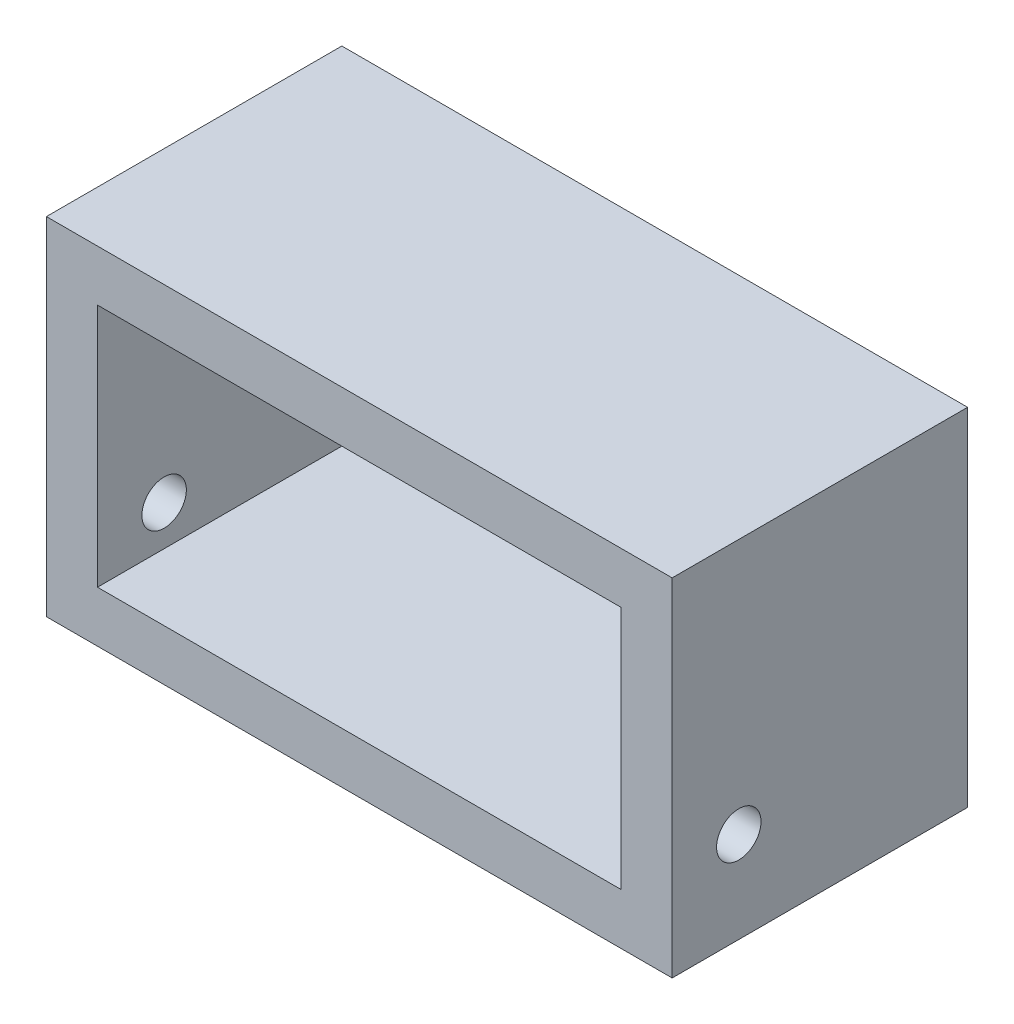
ISO-10303-21;
HEADER;
FILE_DESCRIPTION(('STEP AP214'),'2;1');
FILE_NAME('part.step','',(''),(''),'','','');
FILE_SCHEMA(('AUTOMOTIVE_DESIGN { 1 0 10303 214 1 1 1 1 }'));
ENDSEC;
DATA;
#1=APPLICATION_CONTEXT('core data for automotive mechanical design processes');
#2=APPLICATION_PROTOCOL_DEFINITION('international standard','automotive_design',2000,#1);
#3=PRODUCT_CONTEXT('',#1,'mechanical');
#4=PRODUCT('Part','Part','',(#3));
#5=PRODUCT_RELATED_PRODUCT_CATEGORY('part','',(#4));
#6=PRODUCT_DEFINITION_FORMATION('','',#4);
#7=PRODUCT_DEFINITION_CONTEXT('part definition',#1,'design');
#8=PRODUCT_DEFINITION('design','',#6,#7);
#9=PRODUCT_DEFINITION_SHAPE('','',#8);
#10=(LENGTH_UNIT() NAMED_UNIT(*) SI_UNIT(.MILLI.,.METRE.));
#11=(NAMED_UNIT(*) PLANE_ANGLE_UNIT() SI_UNIT($,.RADIAN.));
#12=(NAMED_UNIT(*) SI_UNIT($,.STERADIAN.) SOLID_ANGLE_UNIT());
#13=UNCERTAINTY_MEASURE_WITH_UNIT(LENGTH_MEASURE(1.E-05),#10,'distance_accuracy_value','');
#14=(GEOMETRIC_REPRESENTATION_CONTEXT(3) GLOBAL_UNCERTAINTY_ASSIGNED_CONTEXT((#13)) GLOBAL_UNIT_ASSIGNED_CONTEXT((#10,
#11,#12)) REPRESENTATION_CONTEXT('',''));
#15=CARTESIAN_POINT('',(0.,0.,0.));
#16=DIRECTION('',(0.,0.,1.));
#17=DIRECTION('',(1.,0.,0.));
#18=AXIS2_PLACEMENT_3D('',#15,#16,#17);
#19=CARTESIAN_POINT('',(117.85,-78.,-110.));
#20=DIRECTION('',(0.,-1.,0.));
#21=DIRECTION('',(1.,0.,0.));
#22=AXIS2_PLACEMENT_3D('',#19,#20,#21);
#23=PLANE('',#22);
#24=DIRECTION('',(1.,0.,0.));
#25=VECTOR('',#24,1.);
#26=CARTESIAN_POINT('',(0.,-78.,0.));
#27=LINE('',#26,#25);
#28=CARTESIAN_POINT('',(-140.85,-78.,0.));
#29=VERTEX_POINT('',#28);
#30=CARTESIAN_POINT('',(140.85,-78.,0.));
#31=VERTEX_POINT('',#30);
#32=EDGE_CURVE('E181',#29,#31,#27,.T.);
#33=ORIENTED_EDGE('',*,*,#32,.F.);
#34=DIRECTION('',(0.,0.,1.));
#35=VECTOR('',#34,1.);
#36=CARTESIAN_POINT('',(-140.85,-78.,-110.));
#37=LINE('',#36,#35);
#38=CARTESIAN_POINT('',(-140.85,-78.,-133.));
#39=VERTEX_POINT('',#38);
#40=EDGE_CURVE('E164',#39,#29,#37,.T.);
#41=ORIENTED_EDGE('',*,*,#40,.F.);
#42=DIRECTION('',(1.,0.,0.));
#43=VECTOR('',#42,1.);
#44=CARTESIAN_POINT('',(0.,-78.,-133.));
#45=LINE('',#44,#43);
#46=CARTESIAN_POINT('',(-117.85,-78.,-133.));
#47=VERTEX_POINT('',#46);
#48=EDGE_CURVE('E175',#39,#47,#45,.T.);
#49=ORIENTED_EDGE('',*,*,#48,.T.);
#50=CARTESIAN_POINT('',(117.85,-78.,-133.));
#51=VERTEX_POINT('',#50);
#52=EDGE_CURVE('E178',#47,#51,#45,.T.);
#53=ORIENTED_EDGE('',*,*,#52,.T.);
#54=CARTESIAN_POINT('',(140.85,-78.,-133.));
#55=VERTEX_POINT('',#54);
#56=EDGE_CURVE('E126',#51,#55,#45,.T.);
#57=ORIENTED_EDGE('',*,*,#56,.T.);
#58=DIRECTION('',(0.,0.,1.));
#59=VECTOR('',#58,1.);
#60=CARTESIAN_POINT('',(140.85,-78.,-110.));
#61=LINE('',#60,#59);
#62=EDGE_CURVE('E166',#55,#31,#61,.T.);
#63=ORIENTED_EDGE('',*,*,#62,.T.);
#64=EDGE_LOOP('',(#33,#41,#49,#53,#57,#63));
#65=FACE_BOUND('',#64,.T.);
#66=CARTESIAN_POINT('',(107.65,-78.,-110.));
#67=DIRECTION('',(0.,-1.,0.));
#68=DIRECTION('',(0.,0.,-1.));
#69=AXIS2_PLACEMENT_3D('',#66,#67,#68);
#70=ELLIPSE('',#69,5.65685424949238,4.00000000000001);
#71=CARTESIAN_POINT('',(107.65,-78.,-115.656854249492));
#72=VERTEX_POINT('',#71);
#73=EDGE_CURVE('E130',#72,#72,#70,.T.);
#74=ORIENTED_EDGE('',*,*,#73,.F.);
#75=EDGE_LOOP('',(#74));
#76=FACE_BOUND('',#75,.T.);
#77=CARTESIAN_POINT('',(-107.65,-78.,-110.));
#78=DIRECTION('',(0.,-1.,0.));
#79=DIRECTION('',(0.,0.,-1.));
#80=AXIS2_PLACEMENT_3D('',#77,#78,#79);
#81=ELLIPSE('',#80,5.65685424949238,4.00000000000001);
#82=CARTESIAN_POINT('',(-107.65,-78.,-115.656854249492));
#83=VERTEX_POINT('',#82);
#84=EDGE_CURVE('E367',#83,#83,#81,.F.);
#85=ORIENTED_EDGE('',*,*,#84,.T.);
#86=EDGE_LOOP('',(#85));
#87=FACE_BOUND('',#86,.T.);
#88=ADVANCED_FACE('F35',(#65,#76,#87),#23,.T.);
#89=CARTESIAN_POINT('',(0.,-77.9999999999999,-133.));
#90=DIRECTION('',(0.,-0.707106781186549,0.707106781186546));
#91=DIRECTION('',(1.,0.,0.));
#92=AXIS2_PLACEMENT_3D('',#89,#90,#91);
#93=PLANE('',#92);
#94=DIRECTION('',(0.,0.707106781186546,0.707106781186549));
#95=VECTOR('',#94,1.);
#96=CARTESIAN_POINT('',(-117.85,-55.,-110.));
#97=LINE('',#96,#95);
#98=CARTESIAN_POINT('',(-117.85,-55.,-110.));
#99=VERTEX_POINT('',#98);
#100=EDGE_CURVE('E11',#99,#47,#97,.F.);
#101=ORIENTED_EDGE('',*,*,#100,.F.);
#102=DIRECTION('',(-1.,0.,0.));
#103=VECTOR('',#102,1.);
#104=CARTESIAN_POINT('',(117.85,-55.,-110.));
#105=LINE('',#104,#103);
#106=CARTESIAN_POINT('',(117.85,-55.,-110.));
#107=VERTEX_POINT('',#106);
#108=EDGE_CURVE('E50',#107,#99,#105,.T.);
#109=ORIENTED_EDGE('',*,*,#108,.F.);
#110=DIRECTION('',(0.,-0.707106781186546,-0.707106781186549));
#111=VECTOR('',#110,1.);
#112=CARTESIAN_POINT('',(117.85,-55.,-110.));
#113=LINE('',#112,#111);
#114=EDGE_CURVE('E43',#51,#107,#113,.F.);
#115=ORIENTED_EDGE('',*,*,#114,.F.);
#116=ORIENTED_EDGE('',*,*,#52,.F.);
#117=EDGE_LOOP('',(#101,#109,#115,#116));
#118=FACE_BOUND('',#117,.T.);
#119=CARTESIAN_POINT('',(107.65,-66.5,-121.5));
#120=DIRECTION('',(0.,0.707106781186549,-0.707106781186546));
#121=DIRECTION('',(0.,0.707106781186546,0.707106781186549));
#122=AXIS2_PLACEMENT_3D('',#119,#120,#121);
#123=CIRCLE('',#122,4.00000000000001);
#124=CARTESIAN_POINT('',(107.65,-63.6715728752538,-118.671572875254));
#125=VERTEX_POINT('',#124);
#126=EDGE_CURVE('E373',#125,#125,#123,.T.);
#127=ORIENTED_EDGE('',*,*,#126,.F.);
#128=EDGE_LOOP('',(#127));
#129=FACE_BOUND('',#128,.T.);
#130=CARTESIAN_POINT('',(-107.65,-66.5,-121.5));
#131=DIRECTION('',(0.,-0.707106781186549,0.707106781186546));
#132=DIRECTION('',(0.,0.707106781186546,0.707106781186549));
#133=AXIS2_PLACEMENT_3D('',#130,#131,#132);
#134=CIRCLE('',#133,4.00000000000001);
#135=CARTESIAN_POINT('',(-107.65,-63.6715728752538,-118.671572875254));
#136=VERTEX_POINT('',#135);
#137=EDGE_CURVE('E370',#136,#136,#134,.T.);
#138=ORIENTED_EDGE('',*,*,#137,.T.);
#139=EDGE_LOOP('',(#138));
#140=FACE_BOUND('',#139,.T.);
#141=ADVANCED_FACE('F37',(#118,#129,#140),#93,.F.);
#142=CARTESIAN_POINT('',(-140.85,-55.,-110.));
#143=DIRECTION('',(-1.,0.,0.));
#144=DIRECTION('',(0.,0.,1.));
#145=AXIS2_PLACEMENT_3D('',#142,#143,#144);
#146=PLANE('',#145);
#147=CARTESIAN_POINT('',(-140.85,-37.,-30.));
#148=DIRECTION('',(-1.,0.,0.));
#149=DIRECTION('',(0.,0.,1.));
#150=AXIS2_PLACEMENT_3D('',#147,#148,#149);
#151=CIRCLE('',#150,10.);
#152=CARTESIAN_POINT('',(-140.85,-37.,-20.));
#153=VERTEX_POINT('',#152);
#154=EDGE_CURVE('E121',#153,#153,#151,.T.);
#155=ORIENTED_EDGE('',*,*,#154,.F.);
#156=EDGE_LOOP('',(#155));
#157=FACE_BOUND('',#156,.T.);
#158=DIRECTION('',(0.,-1.,0.));
#159=VECTOR('',#158,1.);
#160=CARTESIAN_POINT('',(-140.85,0.,0.));
#161=LINE('',#160,#159);
#162=CARTESIAN_POINT('',(-140.85,78.,0.));
#163=VERTEX_POINT('',#162);
#164=EDGE_CURVE('E153',#163,#29,#161,.T.);
#165=ORIENTED_EDGE('',*,*,#164,.F.);
#166=DIRECTION('',(0.,0.,1.));
#167=VECTOR('',#166,1.);
#168=CARTESIAN_POINT('',(-140.85,78.,-110.));
#169=LINE('',#168,#167);
#170=CARTESIAN_POINT('',(-140.85,78.,-133.));
#171=VERTEX_POINT('',#170);
#172=EDGE_CURVE('E157',#171,#163,#169,.T.);
#173=ORIENTED_EDGE('',*,*,#172,.F.);
#174=DIRECTION('',(0.,-1.,0.));
#175=VECTOR('',#174,1.);
#176=CARTESIAN_POINT('',(-140.85,0.,-133.));
#177=LINE('',#176,#175);
#178=EDGE_CURVE('E160',#171,#39,#177,.T.);
#179=ORIENTED_EDGE('',*,*,#178,.T.);
#180=ORIENTED_EDGE('',*,*,#40,.T.);
#181=EDGE_LOOP('',(#165,#173,#179,#180));
#182=FACE_BOUND('',#181,.T.);
#183=ADVANCED_FACE('F219',(#157,#182),#146,.T.);
#184=CARTESIAN_POINT('',(117.85,78.,-110.));
#185=DIRECTION('',(0.,1.,0.));
#186=DIRECTION('',(-1.,0.,0.));
#187=AXIS2_PLACEMENT_3D('',#184,#185,#186);
#188=PLANE('',#187);
#189=DIRECTION('',(-1.,0.,0.));
#190=VECTOR('',#189,1.);
#191=CARTESIAN_POINT('',(0.,78.,0.));
#192=LINE('',#191,#190);
#193=CARTESIAN_POINT('',(140.85,78.,0.));
#194=VERTEX_POINT('',#193);
#195=EDGE_CURVE('E163',#194,#163,#192,.T.);
#196=ORIENTED_EDGE('',*,*,#195,.F.);
#197=DIRECTION('',(0.,0.,1.));
#198=VECTOR('',#197,1.);
#199=CARTESIAN_POINT('',(140.85,78.,-110.));
#200=LINE('',#199,#198);
#201=CARTESIAN_POINT('',(140.85,78.,-133.));
#202=VERTEX_POINT('',#201);
#203=EDGE_CURVE('E159',#202,#194,#200,.T.);
#204=ORIENTED_EDGE('',*,*,#203,.F.);
#205=DIRECTION('',(-1.,0.,0.));
#206=VECTOR('',#205,1.);
#207=CARTESIAN_POINT('',(0.,78.,-133.));
#208=LINE('',#207,#206);
#209=EDGE_CURVE('E167',#202,#171,#208,.T.);
#210=ORIENTED_EDGE('',*,*,#209,.T.);
#211=ORIENTED_EDGE('',*,*,#172,.T.);
#212=EDGE_LOOP('',(#196,#204,#210,#211));
#213=FACE_BOUND('',#212,.T.);
#214=ADVANCED_FACE('F236',(#213),#188,.T.);
#215=CARTESIAN_POINT('',(140.85,-55.,-110.));
#216=DIRECTION('',(1.,0.,0.));
#217=DIRECTION('',(0.,0.,-1.));
#218=AXIS2_PLACEMENT_3D('',#215,#216,#217);
#219=PLANE('',#218);
#220=CARTESIAN_POINT('',(140.85,-37.,-30.));
#221=DIRECTION('',(-1.,0.,0.));
#222=DIRECTION('',(0.,0.,1.));
#223=AXIS2_PLACEMENT_3D('',#220,#221,#222);
#224=CIRCLE('',#223,10.);
#225=CARTESIAN_POINT('',(140.85,-37.,-20.));
#226=VERTEX_POINT('',#225);
#227=EDGE_CURVE('E134',#226,#226,#224,.T.);
#228=ORIENTED_EDGE('',*,*,#227,.T.);
#229=EDGE_LOOP('',(#228));
#230=FACE_BOUND('',#229,.T.);
#231=DIRECTION('',(0.,1.,0.));
#232=VECTOR('',#231,1.);
#233=CARTESIAN_POINT('',(140.85,0.,0.));
#234=LINE('',#233,#232);
#235=EDGE_CURVE('E184',#31,#194,#234,.T.);
#236=ORIENTED_EDGE('',*,*,#235,.F.);
#237=ORIENTED_EDGE('',*,*,#62,.F.);
#238=DIRECTION('',(0.,1.,0.));
#239=VECTOR('',#238,1.);
#240=CARTESIAN_POINT('',(140.85,0.,-133.));
#241=LINE('',#240,#239);
#242=EDGE_CURVE('E171',#55,#202,#241,.T.);
#243=ORIENTED_EDGE('',*,*,#242,.T.);
#244=ORIENTED_EDGE('',*,*,#203,.T.);
#245=EDGE_LOOP('',(#236,#237,#243,#244));
#246=FACE_BOUND('',#245,.T.);
#247=ADVANCED_FACE('F224',(#230,#246),#219,.T.);
#248=CARTESIAN_POINT('',(0.,0.,-133.));
#249=DIRECTION('',(0.,0.,1.));
#250=DIRECTION('',(1.,0.,0.));
#251=AXIS2_PLACEMENT_3D('',#248,#249,#250);
#252=PLANE('',#251);
#253=ORIENTED_EDGE('',*,*,#56,.F.);
#254=DIRECTION('',(0.,1.,0.));
#255=VECTOR('',#254,1.);
#256=CARTESIAN_POINT('',(117.85,55.,-133.));
#257=LINE('',#256,#255);
#258=CARTESIAN_POINT('',(117.85,55.,-133.));
#259=VERTEX_POINT('',#258);
#260=EDGE_CURVE('E107',#51,#259,#257,.T.);
#261=ORIENTED_EDGE('',*,*,#260,.T.);
#262=DIRECTION('',(-1.,0.,0.));
#263=VECTOR('',#262,1.);
#264=CARTESIAN_POINT('',(-117.85,55.,-133.));
#265=LINE('',#264,#263);
#266=CARTESIAN_POINT('',(-117.85,55.,-133.));
#267=VERTEX_POINT('',#266);
#268=EDGE_CURVE('E117',#259,#267,#265,.T.);
#269=ORIENTED_EDGE('',*,*,#268,.T.);
#270=DIRECTION('',(0.,-1.,0.));
#271=VECTOR('',#270,1.);
#272=CARTESIAN_POINT('',(-117.85,55.,-133.));
#273=LINE('',#272,#271);
#274=EDGE_CURVE('E128',#267,#47,#273,.T.);
#275=ORIENTED_EDGE('',*,*,#274,.T.);
#276=ORIENTED_EDGE('',*,*,#48,.F.);
#277=ORIENTED_EDGE('',*,*,#178,.F.);
#278=ORIENTED_EDGE('',*,*,#209,.F.);
#279=ORIENTED_EDGE('',*,*,#242,.F.);
#280=EDGE_LOOP('',(#253,#261,#269,#275,#276,#277,#278,#279));
#281=FACE_BOUND('',#280,.T.);
#282=ADVANCED_FACE('F124',(#281),#252,.F.);
#283=CARTESIAN_POINT('',(0.,0.,0.));
#284=DIRECTION('',(0.,0.,1.));
#285=DIRECTION('',(1.,0.,0.));
#286=AXIS2_PLACEMENT_3D('',#283,#284,#285);
#287=PLANE('',#286);
#288=DIRECTION('',(0.,-1.,0.));
#289=VECTOR('',#288,1.);
#290=CARTESIAN_POINT('',(-117.85,-55.,0.));
#291=LINE('',#290,#289);
#292=CARTESIAN_POINT('',(-117.85,55.,0.));
#293=VERTEX_POINT('',#292);
#294=CARTESIAN_POINT('',(-117.85,-55.,0.));
#295=VERTEX_POINT('',#294);
#296=EDGE_CURVE('E143',#293,#295,#291,.T.);
#297=ORIENTED_EDGE('',*,*,#296,.F.);
#298=DIRECTION('',(-1.,0.,0.));
#299=VECTOR('',#298,1.);
#300=CARTESIAN_POINT('',(117.85,55.,0.));
#301=LINE('',#300,#299);
#302=CARTESIAN_POINT('',(117.85,55.,0.));
#303=VERTEX_POINT('',#302);
#304=EDGE_CURVE('E150',#303,#293,#301,.T.);
#305=ORIENTED_EDGE('',*,*,#304,.F.);
#306=DIRECTION('',(0.,1.,0.));
#307=VECTOR('',#306,1.);
#308=CARTESIAN_POINT('',(117.85,-55.,0.));
#309=LINE('',#308,#307);
#310=CARTESIAN_POINT('',(117.85,-55.,0.));
#311=VERTEX_POINT('',#310);
#312=EDGE_CURVE('E109',#311,#303,#309,.T.);
#313=ORIENTED_EDGE('',*,*,#312,.F.);
#314=DIRECTION('',(1.,0.,0.));
#315=VECTOR('',#314,1.);
#316=CARTESIAN_POINT('',(117.85,-55.,0.));
#317=LINE('',#316,#315);
#318=EDGE_CURVE('E146',#295,#311,#317,.T.);
#319=ORIENTED_EDGE('',*,*,#318,.F.);
#320=EDGE_LOOP('',(#297,#305,#313,#319));
#321=FACE_BOUND('',#320,.T.);
#322=ORIENTED_EDGE('',*,*,#164,.T.);
#323=ORIENTED_EDGE('',*,*,#32,.T.);
#324=ORIENTED_EDGE('',*,*,#235,.T.);
#325=ORIENTED_EDGE('',*,*,#195,.T.);
#326=EDGE_LOOP('',(#322,#323,#324,#325));
#327=FACE_BOUND('',#326,.T.);
#328=ADVANCED_FACE('F227',(#321,#327),#287,.T.);
#329=CARTESIAN_POINT('',(-117.85,-55.,-110.));
#330=DIRECTION('',(-1.,0.,0.));
#331=DIRECTION('',(0.,0.,1.));
#332=AXIS2_PLACEMENT_3D('',#329,#330,#331);
#333=PLANE('',#332);
#334=CARTESIAN_POINT('',(-117.85,-37.,-30.));
#335=DIRECTION('',(-1.,0.,0.));
#336=DIRECTION('',(0.,0.,1.));
#337=AXIS2_PLACEMENT_3D('',#334,#335,#336);
#338=CIRCLE('',#337,10.);
#339=CARTESIAN_POINT('',(-117.85,-37.,-20.));
#340=VERTEX_POINT('',#339);
#341=EDGE_CURVE('E140',#340,#340,#338,.T.);
#342=ORIENTED_EDGE('',*,*,#341,.T.);
#343=EDGE_LOOP('',(#342));
#344=FACE_BOUND('',#343,.T.);
#345=ORIENTED_EDGE('',*,*,#296,.T.);
#346=DIRECTION('',(0.,0.,1.));
#347=VECTOR('',#346,1.);
#348=CARTESIAN_POINT('',(-117.85,-55.,-110.));
#349=LINE('',#348,#347);
#350=EDGE_CURVE('E152',#99,#295,#349,.T.);
#351=ORIENTED_EDGE('',*,*,#350,.F.);
#352=ORIENTED_EDGE('',*,*,#100,.T.);
#353=ORIENTED_EDGE('',*,*,#274,.F.);
#354=DIRECTION('',(0.,0.,1.));
#355=VECTOR('',#354,1.);
#356=CARTESIAN_POINT('',(-117.85,55.,-110.));
#357=LINE('',#356,#355);
#358=EDGE_CURVE('E113',#267,#293,#357,.T.);
#359=ORIENTED_EDGE('',*,*,#358,.T.);
#360=EDGE_LOOP('',(#345,#351,#352,#353,#359));
#361=FACE_BOUND('',#360,.T.);
#362=ADVANCED_FACE('F232',(#344,#361),#333,.F.);
#363=CARTESIAN_POINT('',(117.85,55.,-110.));
#364=DIRECTION('',(0.,1.,0.));
#365=DIRECTION('',(-1.,0.,0.));
#366=AXIS2_PLACEMENT_3D('',#363,#364,#365);
#367=PLANE('',#366);
#368=ORIENTED_EDGE('',*,*,#304,.T.);
#369=ORIENTED_EDGE('',*,*,#358,.F.);
#370=ORIENTED_EDGE('',*,*,#268,.F.);
#371=DIRECTION('',(0.,0.,1.));
#372=VECTOR('',#371,1.);
#373=CARTESIAN_POINT('',(117.85,55.,-110.));
#374=LINE('',#373,#372);
#375=EDGE_CURVE('E103',#259,#303,#374,.T.);
#376=ORIENTED_EDGE('',*,*,#375,.T.);
#377=EDGE_LOOP('',(#368,#369,#370,#376));
#378=FACE_BOUND('',#377,.T.);
#379=ADVANCED_FACE('F118',(#378),#367,.F.);
#380=CARTESIAN_POINT('',(117.85,-55.,-110.));
#381=DIRECTION('',(1.,0.,0.));
#382=DIRECTION('',(0.,0.,-1.));
#383=AXIS2_PLACEMENT_3D('',#380,#381,#382);
#384=PLANE('',#383);
#385=CARTESIAN_POINT('',(117.85,-37.,-30.));
#386=DIRECTION('',(1.,0.,0.));
#387=DIRECTION('',(0.,0.,-1.));
#388=AXIS2_PLACEMENT_3D('',#385,#386,#387);
#389=CIRCLE('',#388,10.);
#390=CARTESIAN_POINT('',(117.85,-37.,-40.));
#391=VERTEX_POINT('',#390);
#392=EDGE_CURVE('E137',#391,#391,#389,.T.);
#393=ORIENTED_EDGE('',*,*,#392,.T.);
#394=EDGE_LOOP('',(#393));
#395=FACE_BOUND('',#394,.T.);
#396=ORIENTED_EDGE('',*,*,#312,.T.);
#397=ORIENTED_EDGE('',*,*,#375,.F.);
#398=ORIENTED_EDGE('',*,*,#260,.F.);
#399=ORIENTED_EDGE('',*,*,#114,.T.);
#400=DIRECTION('',(0.,0.,1.));
#401=VECTOR('',#400,1.);
#402=CARTESIAN_POINT('',(117.85,-55.,-110.));
#403=LINE('',#402,#401);
#404=EDGE_CURVE('E114',#107,#311,#403,.T.);
#405=ORIENTED_EDGE('',*,*,#404,.T.);
#406=EDGE_LOOP('',(#396,#397,#398,#399,#405));
#407=FACE_BOUND('',#406,.T.);
#408=ADVANCED_FACE('F105',(#395,#407),#384,.F.);
#409=CARTESIAN_POINT('',(117.85,-55.,-110.));
#410=DIRECTION('',(0.,-1.,0.));
#411=DIRECTION('',(1.,0.,0.));
#412=AXIS2_PLACEMENT_3D('',#409,#410,#411);
#413=PLANE('',#412);
#414=ORIENTED_EDGE('',*,*,#404,.F.);
#415=ORIENTED_EDGE('',*,*,#108,.T.);
#416=ORIENTED_EDGE('',*,*,#350,.T.);
#417=ORIENTED_EDGE('',*,*,#318,.T.);
#418=EDGE_LOOP('',(#414,#415,#416,#417));
#419=FACE_BOUND('',#418,.T.);
#420=ADVANCED_FACE('F197',(#419),#413,.F.);
#421=CARTESIAN_POINT('',(140.85,-37.,-30.));
#422=DIRECTION('',(-1.,0.,0.));
#423=DIRECTION('',(0.,0.,1.));
#424=AXIS2_PLACEMENT_3D('',#421,#422,#423);
#425=CYLINDRICAL_SURFACE('',#424,10.);
#426=ORIENTED_EDGE('',*,*,#227,.F.);
#427=EDGE_LOOP('',(#426));
#428=FACE_BOUND('',#427,.T.);
#429=ORIENTED_EDGE('',*,*,#392,.F.);
#430=EDGE_LOOP('',(#429));
#431=FACE_BOUND('',#430,.T.);
#432=ADVANCED_FACE('F194',(#428,#431),#425,.F.);
#433=ORIENTED_EDGE('',*,*,#154,.T.);
#434=EDGE_LOOP('',(#433));
#435=FACE_BOUND('',#434,.T.);
#436=ORIENTED_EDGE('',*,*,#341,.F.);
#437=EDGE_LOOP('',(#436));
#438=FACE_BOUND('',#437,.T.);
#439=ADVANCED_FACE('F196',(#435,#438),#425,.F.);
#440=CARTESIAN_POINT('',(107.65,-144.28174593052,-43.7182540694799));
#441=DIRECTION('',(0.,0.707106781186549,-0.707106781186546));
#442=DIRECTION('',(0.,0.707106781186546,0.707106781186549));
#443=AXIS2_PLACEMENT_3D('',#440,#441,#442);
#444=CYLINDRICAL_SURFACE('',#443,4.00000000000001);
#445=ORIENTED_EDGE('',*,*,#73,.T.);
#446=EDGE_LOOP('',(#445));
#447=FACE_BOUND('',#446,.T.);
#448=ORIENTED_EDGE('',*,*,#126,.T.);
#449=EDGE_LOOP('',(#448));
#450=FACE_BOUND('',#449,.T.);
#451=ADVANCED_FACE('F204',(#447,#450),#444,.F.);
#452=CARTESIAN_POINT('',(-107.65,-144.28174593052,-43.7182540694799));
#453=DIRECTION('',(0.,0.707106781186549,-0.707106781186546));
#454=DIRECTION('',(0.,0.707106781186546,0.707106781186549));
#455=AXIS2_PLACEMENT_3D('',#452,#453,#454);
#456=CYLINDRICAL_SURFACE('',#455,4.00000000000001);
#457=ORIENTED_EDGE('',*,*,#84,.F.);
#458=EDGE_LOOP('',(#457));
#459=FACE_BOUND('',#458,.T.);
#460=ORIENTED_EDGE('',*,*,#137,.F.);
#461=EDGE_LOOP('',(#460));
#462=FACE_BOUND('',#461,.T.);
#463=ADVANCED_FACE('F287',(#459,#462),#456,.F.);
#464=CLOSED_SHELL('',(#88,#141,#183,#214,#247,#282,#328,#362,#379,#408,#420,#432,#439,#451,#463));
#465=MANIFOLD_SOLID_BREP('B2',#464);
#466=ADVANCED_BREP_SHAPE_REPRESENTATION('',(#18,#465),#14);
#467=SHAPE_DEFINITION_REPRESENTATION(#9,#466);
ENDSEC;
END-ISO-10303-21;
